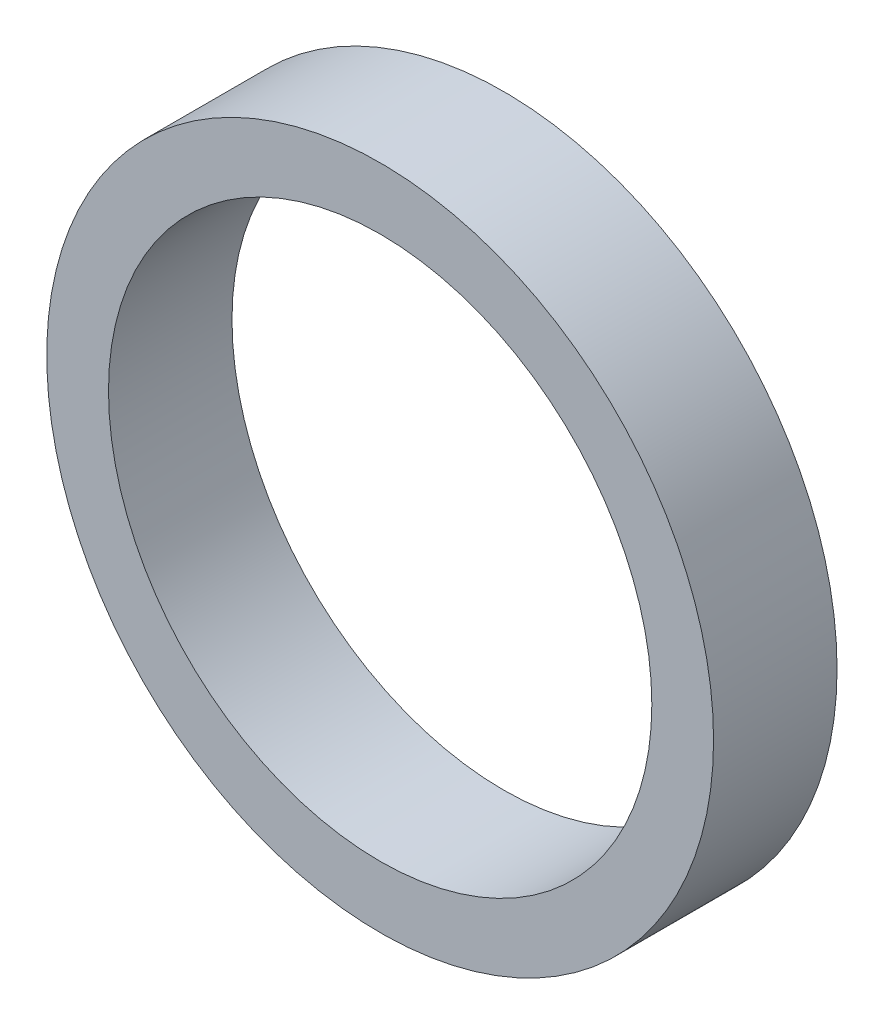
from build123d import *

# Parameters (mm, degrees)
ESQUISSE1_R          = 13.5
ESQUISSE1_R_2        = 11
BASE_EXTRUSION_DEPTH = 5


with BuildPart() as part:
    # Esquisse1 → Base-Extrusion (new body)
    with BuildSketch(Plane.XY):
        Circle(ESQUISSE1_R)
        Circle(ESQUISSE1_R_2, mode=Mode.SUBTRACT)
    extrude(amount=BASE_EXTRUSION_DEPTH)


solid = part.part
